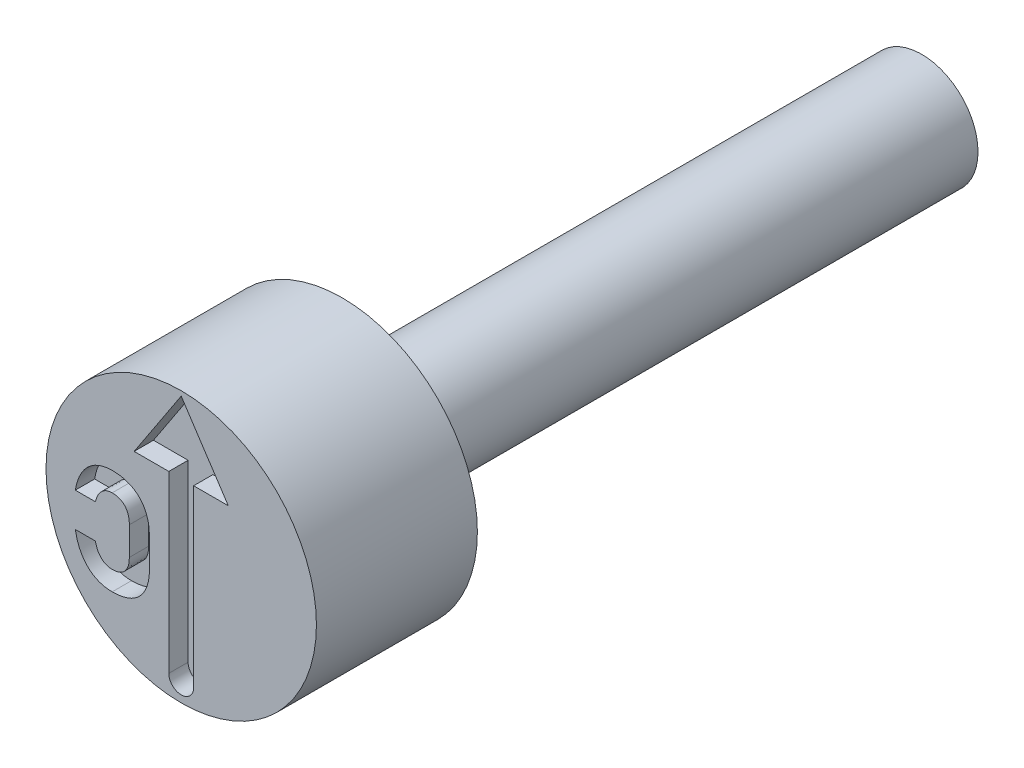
ISO-10303-21;
HEADER;
FILE_DESCRIPTION(('STEP AP214'),'2;1');
FILE_NAME('part.step','',(''),(''),'','','');
FILE_SCHEMA(('AUTOMOTIVE_DESIGN { 1 0 10303 214 1 1 1 1 }'));
ENDSEC;
DATA;
#1=APPLICATION_CONTEXT('core data for automotive mechanical design processes');
#2=APPLICATION_PROTOCOL_DEFINITION('international standard','automotive_design',2000,#1);
#3=PRODUCT_CONTEXT('',#1,'mechanical');
#4=PRODUCT('Part','Part','',(#3));
#5=PRODUCT_RELATED_PRODUCT_CATEGORY('part','',(#4));
#6=PRODUCT_DEFINITION_FORMATION('','',#4);
#7=PRODUCT_DEFINITION_CONTEXT('part definition',#1,'design');
#8=PRODUCT_DEFINITION('design','',#6,#7);
#9=PRODUCT_DEFINITION_SHAPE('','',#8);
#10=(LENGTH_UNIT() NAMED_UNIT(*) SI_UNIT(.MILLI.,.METRE.));
#11=(NAMED_UNIT(*) PLANE_ANGLE_UNIT() SI_UNIT($,.RADIAN.));
#12=(NAMED_UNIT(*) SI_UNIT($,.STERADIAN.) SOLID_ANGLE_UNIT());
#13=UNCERTAINTY_MEASURE_WITH_UNIT(LENGTH_MEASURE(1.E-05),#10,'distance_accuracy_value','');
#14=(GEOMETRIC_REPRESENTATION_CONTEXT(3) GLOBAL_UNCERTAINTY_ASSIGNED_CONTEXT((#13)) GLOBAL_UNIT_ASSIGNED_CONTEXT((#10,
#11,#12)) REPRESENTATION_CONTEXT('',''));
#15=CARTESIAN_POINT('',(0.,0.,0.));
#16=DIRECTION('',(0.,0.,1.));
#17=DIRECTION('',(1.,0.,0.));
#18=AXIS2_PLACEMENT_3D('',#15,#16,#17);
#19=CARTESIAN_POINT('',(0.,1.75,-5.));
#20=DIRECTION('',(0.,0.,1.));
#21=DIRECTION('',(1.,0.,0.));
#22=AXIS2_PLACEMENT_3D('',#19,#20,#21);
#23=PLANE('',#22);
#24=CARTESIAN_POINT('',(0.,0.,-5.));
#25=DIRECTION('',(0.,0.,1.));
#26=DIRECTION('',(1.,0.,0.));
#27=AXIS2_PLACEMENT_3D('',#24,#25,#26);
#28=CIRCLE('',#27,4.2);
#29=CARTESIAN_POINT('',(4.2,0.,-5.));
#30=VERTEX_POINT('',#29);
#31=EDGE_CURVE('E11',#30,#30,#28,.T.);
#32=ORIENTED_EDGE('',*,*,#31,.F.);
#33=EDGE_LOOP('',(#32));
#34=FACE_BOUND('',#33,.T.);
#35=CARTESIAN_POINT('',(0.,0.,-5.));
#36=DIRECTION('',(0.,0.,1.));
#37=DIRECTION('',(1.,0.,0.));
#38=AXIS2_PLACEMENT_3D('',#35,#36,#37);
#39=CIRCLE('',#38,1.75);
#40=CARTESIAN_POINT('',(1.75,0.,-5.));
#41=VERTEX_POINT('',#40);
#42=EDGE_CURVE('E262',#41,#41,#39,.T.);
#43=ORIENTED_EDGE('',*,*,#42,.T.);
#44=EDGE_LOOP('',(#43));
#45=FACE_BOUND('',#44,.T.);
#46=ADVANCED_FACE('F34',(#34,#45),#23,.F.);
#47=CARTESIAN_POINT('',(0.,0.,-0.403888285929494));
#48=DIRECTION('',(0.,0.,1.));
#49=DIRECTION('',(1.,0.,0.));
#50=AXIS2_PLACEMENT_3D('',#47,#48,#49);
#51=CYLINDRICAL_SURFACE('',#50,4.2);
#52=CARTESIAN_POINT('',(0.,0.,0.));
#53=DIRECTION('',(0.,0.,1.));
#54=DIRECTION('',(1.,0.,0.));
#55=AXIS2_PLACEMENT_3D('',#52,#53,#54);
#56=CIRCLE('',#55,4.2);
#57=CARTESIAN_POINT('',(4.2,0.,0.));
#58=VERTEX_POINT('',#57);
#59=EDGE_CURVE('E41',#58,#58,#56,.T.);
#60=ORIENTED_EDGE('',*,*,#59,.F.);
#61=EDGE_LOOP('',(#60));
#62=FACE_BOUND('',#61,.T.);
#63=ORIENTED_EDGE('',*,*,#31,.T.);
#64=EDGE_LOOP('',(#63));
#65=FACE_BOUND('',#64,.T.);
#66=ADVANCED_FACE('F247',(#62,#65),#51,.T.);
#67=CARTESIAN_POINT('',(0.,4.2,0.));
#68=DIRECTION('',(0.,0.,-1.));
#69=DIRECTION('',(-1.,0.,0.));
#70=AXIS2_PLACEMENT_3D('',#67,#68,#69);
#71=PLANE('',#70);
#72=CARTESIAN_POINT('',(-2.14381495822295,-2.28325861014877,0.));
#73=CARTESIAN_POINT('',(-2.11402266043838,-2.28293635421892,0.));
#74=CARTESIAN_POINT('',(-2.05523322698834,-2.28230044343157,0.));
#75=CARTESIAN_POINT('',(-1.96878811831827,-2.27568367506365,0.));
#76=CARTESIAN_POINT('',(-1.88538976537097,-2.26462278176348,0.));
#77=CARTESIAN_POINT('',(-1.80549296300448,-2.24902495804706,0.));
#78=CARTESIAN_POINT('',(-1.72887700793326,-2.22934785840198,0.));
#79=CARTESIAN_POINT('',(-1.65521388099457,-2.20609007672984,0.));
#80=CARTESIAN_POINT('',(-1.58521237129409,-2.17729798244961,0.));
#81=CARTESIAN_POINT('',(-1.51819306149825,-2.14464721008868,0.));
#82=CARTESIAN_POINT('',(-1.45509971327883,-2.10769157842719,0.));
#83=CARTESIAN_POINT('',(-1.39606602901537,-2.06612421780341,0.));
#84=CARTESIAN_POINT('',(-1.34050666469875,-2.02124932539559,0.));
#85=CARTESIAN_POINT('',(-1.28884326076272,-1.9721671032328,0.));
#86=CARTESIAN_POINT('',(-1.24112934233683,-1.91916434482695,0.));
#87=CARTESIAN_POINT('',(-1.19709358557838,-1.86218229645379,0.));
#88=CARTESIAN_POINT('',(-1.15764093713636,-1.80085743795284,0.));
#89=CARTESIAN_POINT('',(-1.12154947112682,-1.73601611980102,0.));
#90=CARTESIAN_POINT('',(-1.08943907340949,-1.66748111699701,0.));
#91=CARTESIAN_POINT('',(-1.06233754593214,-1.5949253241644,0.));
#92=CARTESIAN_POINT('',(-1.03884075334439,-1.51914991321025,0.));
#93=CARTESIAN_POINT('',(-1.01918537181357,-1.4401669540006,0.));
#94=CARTESIAN_POINT('',(-1.00413644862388,-1.35761744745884,0.));
#95=CARTESIAN_POINT('',(-0.99410541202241,-1.2715640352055,0.));
#96=CARTESIAN_POINT('',(-0.987151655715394,-1.18192573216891,0.));
#97=CARTESIAN_POINT('',(-0.986577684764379,-1.12096024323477,0.));
#98=CARTESIAN_POINT('',(-0.9862848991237,-1.08986142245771,0.));
#99=B_SPLINE_CURVE_WITH_KNOTS('',3,(#72,#73,#74,#75,#76,#77,#78,#79,#80,#81,#82,#83,#84,#85,#86,
#87,#88,#89,#90,#91,#92,#93,#94,#95,#96,#97,#98),.UNSPECIFIED.,.F.,.F.,(4,1,1,1,1,1,1,1,1,1,1,1,
1,1,1,1,1,1,1,1,1,1,1,1,4),(0.,0.0472598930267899,0.093258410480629,0.137448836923,
0.180669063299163,0.222325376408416,0.262898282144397,0.303117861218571,0.342294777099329,
0.381096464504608,0.418984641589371,0.456742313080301,0.494310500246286,0.531916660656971,
0.569787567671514,0.608434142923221,0.647492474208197,0.687453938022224,0.728384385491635,
0.770272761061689,0.813266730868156,0.85743965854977,0.903297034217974,0.950671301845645,1.),.UNSPECIFIED.);
#100=CARTESIAN_POINT('',(-2.14381495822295,-2.28325861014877,0.));
#101=VERTEX_POINT('',#100);
#102=CARTESIAN_POINT('',(-0.9862848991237,-1.08986142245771,0.));
#103=VERTEX_POINT('',#102);
#104=EDGE_CURVE('E400',#101,#103,#99,.T.);
#105=ORIENTED_EDGE('',*,*,#104,.F.);
#106=CARTESIAN_POINT('',(-3.29025881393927,-1.17789891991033,0.));
#107=CARTESIAN_POINT('',(-3.27911379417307,-1.23444502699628,0.));
#108=CARTESIAN_POINT('',(-3.25744584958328,-1.34438093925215,0.));
#109=CARTESIAN_POINT('',(-3.2087542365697,-1.50093744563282,0.));
#110=CARTESIAN_POINT('',(-3.14875022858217,-1.64477801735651,0.));
#111=CARTESIAN_POINT('',(-3.07734210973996,-1.77568690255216,0.));
#112=CARTESIAN_POINT('',(-2.99409454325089,-1.89236962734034,0.));
#113=CARTESIAN_POINT('',(-2.90099938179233,-1.99526256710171,0.));
#114=CARTESIAN_POINT('',(-2.79726991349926,-2.08349743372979,0.));
#115=CARTESIAN_POINT('',(-2.6831195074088,-2.1561875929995,0.));
#116=CARTESIAN_POINT('',(-2.55986380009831,-2.21333326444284,0.));
#117=CARTESIAN_POINT('',(-2.42817733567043,-2.25346530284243,0.));
#118=CARTESIAN_POINT('',(-2.28873872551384,-2.27942869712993,0.));
#119=CARTESIAN_POINT('',(-2.19284392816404,-2.28196291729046,0.));
#120=CARTESIAN_POINT('',(-2.14381495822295,-2.28325861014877,0.));
#121=B_SPLINE_CURVE_WITH_KNOTS('',3,(#106,#107,#108,#109,#110,#111,#112,#113,#114,#115,#116,
#117,#118,#119,#120),.UNSPECIFIED.,.F.,.F.,(4,1,1,1,1,1,1,1,1,1,1,1,4),(0.,0.098823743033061,
0.192131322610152,0.28071953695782,0.365844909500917,0.447392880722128,0.526064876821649,
0.603327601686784,0.680299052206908,0.757555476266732,0.835645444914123,0.915969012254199,1.),.UNSPECIFIED.);
#122=CARTESIAN_POINT('',(-3.29025881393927,-1.17789891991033,0.));
#123=VERTEX_POINT('',#122);
#124=EDGE_CURVE('E48',#123,#101,#121,.T.);
#125=ORIENTED_EDGE('',*,*,#124,.F.);
#126=DIRECTION('',(-1.,0.,0.));
#127=VECTOR('',#126,1.);
#128=CARTESIAN_POINT('',(-2.66551864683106,-1.17789891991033,0.));
#129=LINE('',#128,#127);
#130=CARTESIAN_POINT('',(-2.66551864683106,-1.17789891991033,0.));
#131=VERTEX_POINT('',#130);
#132=EDGE_CURVE('E185',#131,#123,#129,.T.);
#133=ORIENTED_EDGE('',*,*,#132,.F.);
#134=CARTESIAN_POINT('',(-2.14381495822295,-1.68003872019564,0.));
#135=CARTESIAN_POINT('',(-2.16536954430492,-1.67918933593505,0.));
#136=CARTESIAN_POINT('',(-2.20764643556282,-1.67752336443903,0.));
#137=CARTESIAN_POINT('',(-2.26940868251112,-1.6673246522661,0.));
#138=CARTESIAN_POINT('',(-2.32755981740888,-1.64852895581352,0.));
#139=CARTESIAN_POINT('',(-2.38249228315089,-1.62320425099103,0.));
#140=CARTESIAN_POINT('',(-2.43380341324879,-1.5904852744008,0.));
#141=CARTESIAN_POINT('',(-2.48003047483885,-1.55005895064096,0.));
#142=CARTESIAN_POINT('',(-2.52308827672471,-1.50404183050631,0.));
#143=CARTESIAN_POINT('',(-2.56141109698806,-1.45093584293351,0.));
#144=CARTESIAN_POINT('',(-2.59538279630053,-1.39150733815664,0.));
#145=CARTESIAN_POINT('',(-2.62379258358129,-1.32573346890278,0.));
#146=CARTESIAN_POINT('',(-2.648453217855,-1.2543467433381,0.));
#147=CARTESIAN_POINT('',(-2.65971367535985,-1.20390338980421,0.));
#148=CARTESIAN_POINT('',(-2.66551864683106,-1.17789891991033,0.));
#149=B_SPLINE_CURVE_WITH_KNOTS('',3,(#134,#135,#136,#137,#138,#139,#140,#141,#142,#143,#144,
#145,#146,#147,#148),.UNSPECIFIED.,.F.,.F.,(4,1,1,1,1,1,1,1,1,1,1,1,4),(0.,0.081756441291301,
0.160356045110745,0.236478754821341,0.312819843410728,0.389192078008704,0.466352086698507,
0.545094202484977,0.627698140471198,0.714093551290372,0.80415108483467,0.89903630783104,1.),.UNSPECIFIED.);
#150=CARTESIAN_POINT('',(-2.14381495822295,-1.68003872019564,0.));
#151=VERTEX_POINT('',#150);
#152=EDGE_CURVE('E188',#151,#131,#149,.T.);
#153=ORIENTED_EDGE('',*,*,#152,.F.);
#154=CARTESIAN_POINT('',(-1.61102506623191,-1.08986142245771,0.));
#155=CARTESIAN_POINT('',(-1.61172801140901,-1.11989880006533,0.));
#156=CARTESIAN_POINT('',(-1.61308875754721,-1.1780445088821,0.));
#157=CARTESIAN_POINT('',(-1.62487750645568,-1.26181245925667,0.));
#158=CARTESIAN_POINT('',(-1.64438127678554,-1.33886599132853,0.));
#159=CARTESIAN_POINT('',(-1.6714405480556,-1.40907376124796,0.));
#160=CARTESIAN_POINT('',(-1.70698483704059,-1.47143383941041,0.));
#161=CARTESIAN_POINT('',(-1.7491962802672,-1.52644994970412,0.));
#162=CARTESIAN_POINT('',(-1.7983187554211,-1.5739892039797,0.));
#163=CARTESIAN_POINT('',(-1.85511474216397,-1.61266859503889,0.));
#164=CARTESIAN_POINT('',(-1.91847350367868,-1.64292402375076,0.));
#165=CARTESIAN_POINT('',(-1.98815257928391,-1.66419137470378,0.));
#166=CARTESIAN_POINT('',(-2.06396630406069,-1.67754135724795,0.));
#167=CARTESIAN_POINT('',(-2.11658468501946,-1.67918706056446,0.));
#168=CARTESIAN_POINT('',(-2.14381495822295,-1.68003872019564,0.));
#169=B_SPLINE_CURVE_WITH_KNOTS('',3,(#154,#155,#156,#157,#158,#159,#160,#161,#162,#163,#164,
#165,#166,#167,#168),.UNSPECIFIED.,.F.,.F.,(4,1,1,1,1,1,1,1,1,1,1,1,4),(0.,0.0997433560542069,
0.193081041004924,0.280299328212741,0.363302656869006,0.442209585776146,0.517891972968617,
0.592965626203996,0.66827505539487,0.745143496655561,0.825309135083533,0.909596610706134,1.),.UNSPECIFIED.);
#170=CARTESIAN_POINT('',(-1.61102506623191,-1.08986142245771,0.));
#171=VERTEX_POINT('',#170);
#172=EDGE_CURVE('E348',#171,#151,#169,.T.);
#173=ORIENTED_EDGE('',*,*,#172,.F.);
#174=DIRECTION('',(0.,-1.,0.));
#175=VECTOR('',#174,1.);
#176=CARTESIAN_POINT('',(-1.61102506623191,-0.212094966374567,0.));
#177=LINE('',#176,#175);
#178=CARTESIAN_POINT('',(-1.61102506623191,-0.212094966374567,0.));
#179=VERTEX_POINT('',#178);
#180=EDGE_CURVE('E356',#179,#171,#177,.T.);
#181=ORIENTED_EDGE('',*,*,#180,.F.);
#182=CARTESIAN_POINT('',(-2.14381495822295,0.380038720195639,0.));
#183=CARTESIAN_POINT('',(-2.11660499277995,0.37908614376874,0.));
#184=CARTESIAN_POINT('',(-2.06406218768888,0.377246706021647,0.));
#185=CARTESIAN_POINT('',(-1.98794448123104,0.365263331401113,0.));
#186=CARTESIAN_POINT('',(-1.91860966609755,0.342688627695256,0.));
#187=CARTESIAN_POINT('',(-1.85508938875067,0.31274098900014,0.));
#188=CARTESIAN_POINT('',(-1.79834595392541,0.27395315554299,0.));
#189=CARTESIAN_POINT('',(-1.74898758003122,0.226402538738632,0.));
#190=CARTESIAN_POINT('',(-1.70698935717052,0.170734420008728,0.));
#191=CARTESIAN_POINT('',(-1.67159986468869,0.107906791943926,0.));
#192=CARTESIAN_POINT('',(-1.64423601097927,0.0373868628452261,0.));
#193=CARTESIAN_POINT('',(-1.62498243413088,-0.0399553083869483,0.));
#194=CARTESIAN_POINT('',(-1.61306786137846,-0.12390621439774,0.));
#195=CARTESIAN_POINT('',(-1.61172089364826,-0.182055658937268,0.));
#196=CARTESIAN_POINT('',(-1.61102506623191,-0.212094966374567,0.));
#197=B_SPLINE_CURVE_WITH_KNOTS('',3,(#182,#183,#184,#185,#186,#187,#188,#189,#190,#191,#192,
#193,#194,#195,#196),.UNSPECIFIED.,.F.,.F.,(4,1,1,1,1,1,1,1,1,1,1,1,4),(0.,0.0902231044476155,
0.174222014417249,0.25444494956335,0.331160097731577,0.406319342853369,0.481243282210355,
0.557346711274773,0.636723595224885,0.719561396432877,0.807304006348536,0.900455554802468,1.),.UNSPECIFIED.);
#198=CARTESIAN_POINT('',(-2.14381495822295,0.380038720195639,0.));
#199=VERTEX_POINT('',#198);
#200=EDGE_CURVE('E362',#199,#179,#197,.T.);
#201=ORIENTED_EDGE('',*,*,#200,.F.);
#202=CARTESIAN_POINT('',(-2.66551864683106,-0.121448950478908,0.));
#203=CARTESIAN_POINT('',(-2.65921699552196,-0.0958874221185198,0.));
#204=CARTESIAN_POINT('',(-2.64695455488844,-0.0461470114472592,0.));
#205=CARTESIAN_POINT('',(-2.62170707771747,0.024612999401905,0.));
#206=CARTESIAN_POINT('',(-2.59299817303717,0.0901557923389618,0.));
#207=CARTESIAN_POINT('',(-2.55788725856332,0.148919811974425,0.));
#208=CARTESIAN_POINT('',(-2.519665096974,0.202323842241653,0.));
#209=CARTESIAN_POINT('',(-2.4765593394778,0.248591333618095,0.));
#210=CARTESIAN_POINT('',(-2.42951346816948,0.288489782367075,0.));
#211=CARTESIAN_POINT('',(-2.37889075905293,0.321488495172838,0.));
#212=CARTESIAN_POINT('',(-2.3248290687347,0.348381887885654,0.));
#213=CARTESIAN_POINT('',(-2.26708234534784,0.366180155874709,0.));
#214=CARTESIAN_POINT('',(-2.20644779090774,0.377802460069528,0.));
#215=CARTESIAN_POINT('',(-2.16495562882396,0.37928390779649,0.));
#216=CARTESIAN_POINT('',(-2.14381495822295,0.380038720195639,0.));
#217=B_SPLINE_CURVE_WITH_KNOTS('',3,(#202,#203,#204,#205,#206,#207,#208,#209,#210,#211,#212,
#213,#214,#215,#216),.UNSPECIFIED.,.F.,.F.,(4,1,1,1,1,1,1,1,1,1,1,1,4),(0.,0.100258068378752,
0.195093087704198,0.285925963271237,0.372441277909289,0.455447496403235,0.535743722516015,
0.612742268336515,0.689936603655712,0.765509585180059,0.842003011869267,0.919498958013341,1.),.UNSPECIFIED.);
#218=CARTESIAN_POINT('',(-2.66551864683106,-0.121448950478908,0.));
#219=VERTEX_POINT('',#218);
#220=EDGE_CURVE('E367',#219,#199,#217,.T.);
#221=ORIENTED_EDGE('',*,*,#220,.F.);
#222=DIRECTION('',(1.,0.,0.));
#223=VECTOR('',#222,1.);
#224=CARTESIAN_POINT('',(-3.29025881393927,-0.121448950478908,0.));
#225=LINE('',#224,#223);
#226=CARTESIAN_POINT('',(-3.29025881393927,-0.121448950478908,0.));
#227=VERTEX_POINT('',#226);
#228=EDGE_CURVE('E375',#227,#219,#225,.T.);
#229=ORIENTED_EDGE('',*,*,#228,.F.);
#230=CARTESIAN_POINT('',(-2.14381495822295,0.983258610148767,0.));
#231=CARTESIAN_POINT('',(-2.1928414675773,0.981946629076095,0.));
#232=CARTESIAN_POINT('',(-2.28894564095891,0.979374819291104,0.));
#233=CARTESIAN_POINT('',(-2.42862557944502,0.953552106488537,0.));
#234=CARTESIAN_POINT('',(-2.56052908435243,0.913349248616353,0.));
#235=CARTESIAN_POINT('',(-2.6838852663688,0.856023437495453,0.));
#236=CARTESIAN_POINT('',(-2.79830794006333,0.783695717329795,0.));
#237=CARTESIAN_POINT('',(-2.90245748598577,0.695695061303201,0.));
#238=CARTESIAN_POINT('',(-2.99629887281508,0.59317388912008,0.));
#239=CARTESIAN_POINT('',(-3.07902206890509,0.475713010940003,0.));
#240=CARTESIAN_POINT('',(-3.15086271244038,0.344951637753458,0.));
#241=CARTESIAN_POINT('',(-3.21000466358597,0.200873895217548,0.));
#242=CARTESIAN_POINT('',(-3.25801038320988,0.0445539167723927,0.));
#243=CARTESIAN_POINT('',(-3.27931719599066,-0.0651255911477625,0.));
#244=CARTESIAN_POINT('',(-3.29025881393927,-0.121448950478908,0.));
#245=B_SPLINE_CURVE_WITH_KNOTS('',3,(#230,#231,#232,#233,#234,#235,#236,#237,#238,#239,#240,
#241,#242,#243,#244),.UNSPECIFIED.,.F.,.F.,(4,1,1,1,1,1,1,1,1,1,1,1,4),(0.,0.0840057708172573,
0.164672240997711,0.242738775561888,0.319972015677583,0.397234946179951,0.474233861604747,
0.553133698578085,0.634960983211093,0.720060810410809,0.808478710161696,0.901648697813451,1.),.UNSPECIFIED.);
#246=CARTESIAN_POINT('',(-2.14381495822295,0.983258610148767,0.));
#247=VERTEX_POINT('',#246);
#248=EDGE_CURVE('E381',#247,#227,#245,.T.);
#249=ORIENTED_EDGE('',*,*,#248,.F.);
#250=CARTESIAN_POINT('',(-0.9862848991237,-0.212094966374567,0.));
#251=CARTESIAN_POINT('',(-0.986577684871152,-0.180996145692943,0.));
#252=CARTESIAN_POINT('',(-0.987151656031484,-0.120030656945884,0.));
#253=CARTESIAN_POINT('',(-0.994105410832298,-0.0303923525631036,0.));
#254=CARTESIAN_POINT('',(-1.00413645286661,0.0556610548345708,0.));
#255=CARTESIAN_POINT('',(-1.0191853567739,0.13821057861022,0.));
#256=CARTESIAN_POINT('',(-1.03884080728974,0.217193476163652,0.));
#257=CARTESIAN_POINT('',(-1.06233735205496,0.292969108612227,0.));
#258=CARTESIAN_POINT('',(-1.08943977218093,0.365524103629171,0.));
#259=CARTESIAN_POINT('',(-1.1215469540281,0.434061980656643,0.));
#260=CARTESIAN_POINT('',(-1.15765006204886,0.498892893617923,0.));
#261=CARTESIAN_POINT('',(-1.19706018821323,0.560255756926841,0.));
#262=CARTESIAN_POINT('',(-1.2413503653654,0.617227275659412,0.));
#263=CARTESIAN_POINT('',(-1.28861113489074,0.670853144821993,0.));
#264=CARTESIAN_POINT('',(-1.34053575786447,0.71992116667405,0.));
#265=CARTESIAN_POINT('',(-1.39606451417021,0.764813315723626,0.));
#266=CARTESIAN_POINT('',(-1.45507624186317,0.806438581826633,0.));
#267=CARTESIAN_POINT('',(-1.51837505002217,0.843186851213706,0.));
#268=CARTESIAN_POINT('',(-1.58500837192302,0.876859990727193,0.));
#269=CARTESIAN_POINT('',(-1.65537256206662,0.905195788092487,0.));
#270=CARTESIAN_POINT('',(-1.72873256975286,0.929566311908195,0.));
#271=CARTESIAN_POINT('',(-1.80551526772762,0.948958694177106,0.));
#272=CARTESIAN_POINT('',(-1.8853835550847,0.964641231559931,0.));
#273=CARTESIAN_POINT('',(-1.96878986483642,0.975678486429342,0.));
#274=CARTESIAN_POINT('',(-2.05523276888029,0.982301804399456,0.));
#275=CARTESIAN_POINT('',(-2.11402250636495,0.982936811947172,0.));
#276=CARTESIAN_POINT('',(-2.14381495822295,0.983258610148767,0.));
#277=B_SPLINE_CURVE_WITH_KNOTS('',3,(#250,#251,#252,#253,#254,#255,#256,#257,#258,#259,#260,
#261,#262,#263,#264,#265,#266,#267,#268,#269,#270,#271,#272,#273,#274,#275,#276),.UNSPECIFIED.,
.F.,.F.,(4,1,1,1,1,1,1,1,1,1,1,1,1,1,1,1,1,1,1,1,1,1,1,1,4),(0.,0.0493032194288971,
0.0966530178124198,0.142486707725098,0.186636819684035,0.229608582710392,0.271475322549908,
0.312384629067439,0.352325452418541,0.391363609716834,0.429990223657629,0.467841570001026,
0.505685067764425,0.543233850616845,0.580972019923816,0.618840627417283,0.657622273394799,
0.69693189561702,0.737130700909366,0.777789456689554,0.819424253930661,0.862622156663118,
0.906789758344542,0.952764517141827,1.),.UNSPECIFIED.);
#278=CARTESIAN_POINT('',(-0.9862848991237,-0.212094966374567,0.));
#279=VERTEX_POINT('',#278);
#280=EDGE_CURVE('E386',#279,#247,#277,.T.);
#281=ORIENTED_EDGE('',*,*,#280,.F.);
#282=DIRECTION('',(0.,1.,0.));
#283=VECTOR('',#282,1.);
#284=CARTESIAN_POINT('',(-0.9862848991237,-1.08986142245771,0.));
#285=LINE('',#284,#283);
#286=EDGE_CURVE('E394',#103,#279,#285,.T.);
#287=ORIENTED_EDGE('',*,*,#286,.F.);
#288=EDGE_LOOP('',(#105,#125,#133,#153,#173,#181,#201,#221,#229,#249,#281,#287));
#289=FACE_BOUND('',#288,.T.);
#290=DIRECTION('',(0.,1.,0.));
#291=VECTOR('',#290,1.);
#292=CARTESIAN_POINT('',(0.385708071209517,1.83536164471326,0.));
#293=LINE('',#292,#291);
#294=CARTESIAN_POINT('',(0.385708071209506,-3.59672771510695,0.));
#295=VERTEX_POINT('',#294);
#296=CARTESIAN_POINT('',(0.385708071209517,1.83536164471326,0.));
#297=VERTEX_POINT('',#296);
#298=EDGE_CURVE('E300',#295,#297,#293,.T.);
#299=ORIENTED_EDGE('',*,*,#298,.F.);
#300=CARTESIAN_POINT('',(3.30934598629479E-13,-3.59672771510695,0.));
#301=DIRECTION('',(0.,0.,1.));
#302=DIRECTION('',(1.,0.,0.));
#303=AXIS2_PLACEMENT_3D('',#300,#301,#302);
#304=CIRCLE('',#303,0.385708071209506);
#305=CARTESIAN_POINT('',(-0.385708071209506,-3.59672771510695,0.));
#306=VERTEX_POINT('',#305);
#307=EDGE_CURVE('E56',#306,#295,#304,.T.);
#308=ORIENTED_EDGE('',*,*,#307,.F.);
#309=DIRECTION('',(0.,-1.,0.));
#310=VECTOR('',#309,1.);
#311=CARTESIAN_POINT('',(-0.385708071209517,1.83536164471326,0.));
#312=LINE('',#311,#310);
#313=CARTESIAN_POINT('',(-0.385708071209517,1.83536164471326,0.));
#314=VERTEX_POINT('',#313);
#315=EDGE_CURVE('E284',#314,#306,#312,.T.);
#316=ORIENTED_EDGE('',*,*,#315,.F.);
#317=DIRECTION('',(1.,0.,0.));
#318=VECTOR('',#317,1.);
#319=CARTESIAN_POINT('',(-1.46188328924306,1.83536164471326,0.));
#320=LINE('',#319,#318);
#321=CARTESIAN_POINT('',(-1.46188328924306,1.83536164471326,0.));
#322=VERTEX_POINT('',#321);
#323=EDGE_CURVE('E288',#322,#314,#320,.T.);
#324=ORIENTED_EDGE('',*,*,#323,.F.);
#325=DIRECTION('',(-0.550159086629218,-0.835059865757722,0.));
#326=VECTOR('',#325,1.);
#327=CARTESIAN_POINT('',(0.,4.05428357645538,0.));
#328=LINE('',#327,#326);
#329=CARTESIAN_POINT('',(0.,4.05428357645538,0.));
#330=VERTEX_POINT('',#329);
#331=EDGE_CURVE('E291',#330,#322,#328,.T.);
#332=ORIENTED_EDGE('',*,*,#331,.F.);
#333=DIRECTION('',(-0.550159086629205,0.835059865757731,0.));
#334=VECTOR('',#333,1.);
#335=CARTESIAN_POINT('',(0.,4.05428357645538,0.));
#336=LINE('',#335,#334);
#337=CARTESIAN_POINT('',(1.46188328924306,1.83536164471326,0.));
#338=VERTEX_POINT('',#337);
#339=EDGE_CURVE('E294',#338,#330,#336,.T.);
#340=ORIENTED_EDGE('',*,*,#339,.F.);
#341=DIRECTION('',(1.,0.,0.));
#342=VECTOR('',#341,1.);
#343=CARTESIAN_POINT('',(1.46188328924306,1.83536164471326,0.));
#344=LINE('',#343,#342);
#345=EDGE_CURVE('E297',#297,#338,#344,.T.);
#346=ORIENTED_EDGE('',*,*,#345,.F.);
#347=EDGE_LOOP('',(#299,#308,#316,#324,#332,#340,#346));
#348=FACE_BOUND('',#347,.T.);
#349=ORIENTED_EDGE('',*,*,#59,.T.);
#350=EDGE_LOOP('',(#349));
#351=FACE_BOUND('',#350,.T.);
#352=ADVANCED_FACE('F244',(#289,#348,#351),#71,.F.);
#353=CARTESIAN_POINT('',(0.,0.,-23.));
#354=DIRECTION('',(0.,0.,1.));
#355=DIRECTION('',(1.,0.,0.));
#356=AXIS2_PLACEMENT_3D('',#353,#354,#355);
#357=PLANE('',#356);
#358=CARTESIAN_POINT('',(0.,0.,-23.));
#359=DIRECTION('',(0.,0.,1.));
#360=DIRECTION('',(1.,0.,0.));
#361=AXIS2_PLACEMENT_3D('',#358,#359,#360);
#362=CIRCLE('',#361,1.75);
#363=CARTESIAN_POINT('',(1.75,0.,-23.));
#364=VERTEX_POINT('',#363);
#365=EDGE_CURVE('E263',#364,#364,#362,.T.);
#366=ORIENTED_EDGE('',*,*,#365,.F.);
#367=EDGE_LOOP('',(#366));
#368=FACE_BOUND('',#367,.T.);
#369=ADVANCED_FACE('F240',(#368),#357,.F.);
#370=CARTESIAN_POINT('',(0.,0.,-0.403888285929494));
#371=DIRECTION('',(0.,0.,1.));
#372=DIRECTION('',(1.,0.,0.));
#373=AXIS2_PLACEMENT_3D('',#370,#371,#372);
#374=CYLINDRICAL_SURFACE('',#373,1.75);
#375=ORIENTED_EDGE('',*,*,#42,.F.);
#376=EDGE_LOOP('',(#375));
#377=FACE_BOUND('',#376,.T.);
#378=ORIENTED_EDGE('',*,*,#365,.T.);
#379=EDGE_LOOP('',(#378));
#380=FACE_BOUND('',#379,.T.);
#381=ADVANCED_FACE('F237',(#377,#380),#374,.T.);
#382=CARTESIAN_POINT('',(3.30934598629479E-13,-3.59672771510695,-0.6));
#383=DIRECTION('',(0.,0.,1.));
#384=DIRECTION('',(1.,0.,0.));
#385=AXIS2_PLACEMENT_3D('',#382,#383,#384);
#386=CYLINDRICAL_SURFACE('',#385,0.385708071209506);
#387=ORIENTED_EDGE('',*,*,#307,.T.);
#388=DIRECTION('',(0.,0.,1.));
#389=VECTOR('',#388,1.);
#390=CARTESIAN_POINT('',(0.385708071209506,-3.59672771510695,-0.6));
#391=LINE('',#390,#389);
#392=CARTESIAN_POINT('',(0.385708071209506,-3.59672771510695,-0.6));
#393=VERTEX_POINT('',#392);
#394=EDGE_CURVE('E271',#393,#295,#391,.T.);
#395=ORIENTED_EDGE('',*,*,#394,.F.);
#396=CARTESIAN_POINT('',(3.30934598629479E-13,-3.59672771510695,-0.6));
#397=DIRECTION('',(0.,0.,1.));
#398=DIRECTION('',(1.,0.,0.));
#399=AXIS2_PLACEMENT_3D('',#396,#397,#398);
#400=CIRCLE('',#399,0.385708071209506);
#401=CARTESIAN_POINT('',(-0.385708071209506,-3.59672771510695,-0.6));
#402=VERTEX_POINT('',#401);
#403=EDGE_CURVE('E287',#402,#393,#400,.T.);
#404=ORIENTED_EDGE('',*,*,#403,.F.);
#405=DIRECTION('',(0.,0.,1.));
#406=VECTOR('',#405,1.);
#407=CARTESIAN_POINT('',(-0.385708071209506,-3.59672771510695,-0.6));
#408=LINE('',#407,#406);
#409=EDGE_CURVE('E264',#402,#306,#408,.T.);
#410=ORIENTED_EDGE('',*,*,#409,.T.);
#411=EDGE_LOOP('',(#387,#395,#404,#410));
#412=FACE_BOUND('',#411,.T.);
#413=ADVANCED_FACE('F215',(#412),#386,.F.);
#414=CARTESIAN_POINT('',(-0.385708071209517,1.83536164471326,-0.6));
#415=DIRECTION('',(-1.,0.,0.));
#416=DIRECTION('',(0.,-1.,0.));
#417=AXIS2_PLACEMENT_3D('',#414,#415,#416);
#418=PLANE('',#417);
#419=ORIENTED_EDGE('',*,*,#315,.T.);
#420=ORIENTED_EDGE('',*,*,#409,.F.);
#421=DIRECTION('',(0.,-1.,0.));
#422=VECTOR('',#421,1.);
#423=CARTESIAN_POINT('',(-0.385708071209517,1.83536164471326,-0.6));
#424=LINE('',#423,#422);
#425=CARTESIAN_POINT('',(-0.385708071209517,1.83536164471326,-0.6));
#426=VERTEX_POINT('',#425);
#427=EDGE_CURVE('E275',#426,#402,#424,.T.);
#428=ORIENTED_EDGE('',*,*,#427,.F.);
#429=DIRECTION('',(0.,0.,1.));
#430=VECTOR('',#429,1.);
#431=CARTESIAN_POINT('',(-0.385708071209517,1.83536164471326,-0.6));
#432=LINE('',#431,#430);
#433=EDGE_CURVE('E268',#426,#314,#432,.T.);
#434=ORIENTED_EDGE('',*,*,#433,.T.);
#435=EDGE_LOOP('',(#419,#420,#428,#434));
#436=FACE_BOUND('',#435,.T.);
#437=ADVANCED_FACE('F211',(#436),#418,.F.);
#438=CARTESIAN_POINT('',(-1.46188328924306,1.83536164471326,-0.6));
#439=DIRECTION('',(0.,-1.,0.));
#440=DIRECTION('',(0.,0.,-1.));
#441=AXIS2_PLACEMENT_3D('',#438,#439,#440);
#442=PLANE('',#441);
#443=ORIENTED_EDGE('',*,*,#323,.T.);
#444=ORIENTED_EDGE('',*,*,#433,.F.);
#445=DIRECTION('',(1.,0.,0.));
#446=VECTOR('',#445,1.);
#447=CARTESIAN_POINT('',(-1.46188328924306,1.83536164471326,-0.6));
#448=LINE('',#447,#446);
#449=CARTESIAN_POINT('',(-1.46188328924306,1.83536164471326,-0.6));
#450=VERTEX_POINT('',#449);
#451=EDGE_CURVE('E307',#450,#426,#448,.T.);
#452=ORIENTED_EDGE('',*,*,#451,.F.);
#453=DIRECTION('',(0.,0.,1.));
#454=VECTOR('',#453,1.);
#455=CARTESIAN_POINT('',(-1.46188328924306,1.83536164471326,-0.6));
#456=LINE('',#455,#454);
#457=EDGE_CURVE('E281',#450,#322,#456,.T.);
#458=ORIENTED_EDGE('',*,*,#457,.T.);
#459=EDGE_LOOP('',(#443,#444,#452,#458));
#460=FACE_BOUND('',#459,.T.);
#461=ADVANCED_FACE('F214',(#460),#442,.F.);
#462=CARTESIAN_POINT('',(0.,4.05428357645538,-0.6));
#463=DIRECTION('',(-0.835059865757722,0.550159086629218,0.));
#464=DIRECTION('',(-0.550159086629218,-0.835059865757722,0.));
#465=AXIS2_PLACEMENT_3D('',#462,#463,#464);
#466=PLANE('',#465);
#467=ORIENTED_EDGE('',*,*,#331,.T.);
#468=ORIENTED_EDGE('',*,*,#457,.F.);
#469=DIRECTION('',(-0.550159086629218,-0.835059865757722,0.));
#470=VECTOR('',#469,1.);
#471=CARTESIAN_POINT('',(0.,4.05428357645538,-0.6));
#472=LINE('',#471,#470);
#473=CARTESIAN_POINT('',(0.,4.05428357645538,-0.6));
#474=VERTEX_POINT('',#473);
#475=EDGE_CURVE('E310',#474,#450,#472,.T.);
#476=ORIENTED_EDGE('',*,*,#475,.F.);
#477=DIRECTION('',(0.,0.,1.));
#478=VECTOR('',#477,1.);
#479=CARTESIAN_POINT('',(0.,4.05428357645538,-0.6));
#480=LINE('',#479,#478);
#481=EDGE_CURVE('E279',#474,#330,#480,.T.);
#482=ORIENTED_EDGE('',*,*,#481,.T.);
#483=EDGE_LOOP('',(#467,#468,#476,#482));
#484=FACE_BOUND('',#483,.T.);
#485=ADVANCED_FACE('F219',(#484),#466,.F.);
#486=CARTESIAN_POINT('',(0.,4.05428357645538,-0.6));
#487=DIRECTION('',(0.835059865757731,0.550159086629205,0.));
#488=DIRECTION('',(-0.550159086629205,0.835059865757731,0.));
#489=AXIS2_PLACEMENT_3D('',#486,#487,#488);
#490=PLANE('',#489);
#491=ORIENTED_EDGE('',*,*,#339,.T.);
#492=ORIENTED_EDGE('',*,*,#481,.F.);
#493=DIRECTION('',(-0.550159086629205,0.835059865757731,0.));
#494=VECTOR('',#493,1.);
#495=CARTESIAN_POINT('',(0.,4.05428357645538,-0.6));
#496=LINE('',#495,#494);
#497=CARTESIAN_POINT('',(1.46188328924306,1.83536164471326,-0.6));
#498=VERTEX_POINT('',#497);
#499=EDGE_CURVE('E313',#498,#474,#496,.T.);
#500=ORIENTED_EDGE('',*,*,#499,.F.);
#501=DIRECTION('',(0.,0.,1.));
#502=VECTOR('',#501,1.);
#503=CARTESIAN_POINT('',(1.46188328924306,1.83536164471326,-0.6));
#504=LINE('',#503,#502);
#505=EDGE_CURVE('E277',#498,#338,#504,.T.);
#506=ORIENTED_EDGE('',*,*,#505,.T.);
#507=EDGE_LOOP('',(#491,#492,#500,#506));
#508=FACE_BOUND('',#507,.T.);
#509=ADVANCED_FACE('F223',(#508),#490,.F.);
#510=CARTESIAN_POINT('',(1.46188328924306,1.83536164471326,-0.6));
#511=DIRECTION('',(0.,-1.,0.));
#512=DIRECTION('',(0.,0.,-1.));
#513=AXIS2_PLACEMENT_3D('',#510,#511,#512);
#514=PLANE('',#513);
#515=ORIENTED_EDGE('',*,*,#345,.T.);
#516=ORIENTED_EDGE('',*,*,#505,.F.);
#517=DIRECTION('',(1.,0.,0.));
#518=VECTOR('',#517,1.);
#519=CARTESIAN_POINT('',(1.46188328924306,1.83536164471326,-0.6));
#520=LINE('',#519,#518);
#521=CARTESIAN_POINT('',(0.385708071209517,1.83536164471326,-0.6));
#522=VERTEX_POINT('',#521);
#523=EDGE_CURVE('E316',#522,#498,#520,.T.);
#524=ORIENTED_EDGE('',*,*,#523,.F.);
#525=DIRECTION('',(0.,0.,1.));
#526=VECTOR('',#525,1.);
#527=CARTESIAN_POINT('',(0.385708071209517,1.83536164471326,-0.6));
#528=LINE('',#527,#526);
#529=EDGE_CURVE('E274',#522,#297,#528,.T.);
#530=ORIENTED_EDGE('',*,*,#529,.T.);
#531=EDGE_LOOP('',(#515,#516,#524,#530));
#532=FACE_BOUND('',#531,.T.);
#533=ADVANCED_FACE('F227',(#532),#514,.F.);
#534=CARTESIAN_POINT('',(0.385708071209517,1.83536164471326,-0.6));
#535=DIRECTION('',(1.,0.,0.));
#536=DIRECTION('',(0.,1.,0.));
#537=AXIS2_PLACEMENT_3D('',#534,#535,#536);
#538=PLANE('',#537);
#539=ORIENTED_EDGE('',*,*,#298,.T.);
#540=ORIENTED_EDGE('',*,*,#529,.F.);
#541=DIRECTION('',(0.,1.,0.));
#542=VECTOR('',#541,1.);
#543=CARTESIAN_POINT('',(0.385708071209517,1.83536164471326,-0.6));
#544=LINE('',#543,#542);
#545=EDGE_CURVE('E319',#393,#522,#544,.T.);
#546=ORIENTED_EDGE('',*,*,#545,.F.);
#547=ORIENTED_EDGE('',*,*,#394,.T.);
#548=EDGE_LOOP('',(#539,#540,#546,#547));
#549=FACE_BOUND('',#548,.T.);
#550=ADVANCED_FACE('F209',(#549),#538,.F.);
#551=CARTESIAN_POINT('',(3.30934598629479E-13,-3.59672771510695,-0.6));
#552=DIRECTION('',(0.,0.,1.));
#553=DIRECTION('',(1.,0.,0.));
#554=AXIS2_PLACEMENT_3D('',#551,#552,#553);
#555=PLANE('',#554);
#556=ORIENTED_EDGE('',*,*,#403,.T.);
#557=ORIENTED_EDGE('',*,*,#545,.T.);
#558=ORIENTED_EDGE('',*,*,#523,.T.);
#559=ORIENTED_EDGE('',*,*,#499,.T.);
#560=ORIENTED_EDGE('',*,*,#475,.T.);
#561=ORIENTED_EDGE('',*,*,#451,.T.);
#562=ORIENTED_EDGE('',*,*,#427,.T.);
#563=EDGE_LOOP('',(#556,#557,#558,#559,#560,#561,#562));
#564=FACE_BOUND('',#563,.T.);
#565=ADVANCED_FACE('F205',(#564),#555,.T.);
#566=CARTESIAN_POINT('',(-3.29025881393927,-1.17789891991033,-0.6));
#567=CARTESIAN_POINT('',(-3.27911379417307,-1.23444502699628,-0.6));
#568=CARTESIAN_POINT('',(-3.25744584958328,-1.34438093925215,-0.6));
#569=CARTESIAN_POINT('',(-3.2087542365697,-1.50093744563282,-0.6));
#570=CARTESIAN_POINT('',(-3.14875022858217,-1.64477801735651,-0.6));
#571=CARTESIAN_POINT('',(-3.07734210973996,-1.77568690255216,-0.6));
#572=CARTESIAN_POINT('',(-2.99409454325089,-1.89236962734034,-0.6));
#573=CARTESIAN_POINT('',(-2.90099938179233,-1.99526256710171,-0.6));
#574=CARTESIAN_POINT('',(-2.79726991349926,-2.08349743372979,-0.6));
#575=CARTESIAN_POINT('',(-2.6831195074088,-2.1561875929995,-0.6));
#576=CARTESIAN_POINT('',(-2.55986380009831,-2.21333326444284,-0.6));
#577=CARTESIAN_POINT('',(-2.42817733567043,-2.25346530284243,-0.6));
#578=CARTESIAN_POINT('',(-2.28873872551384,-2.27942869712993,-0.6));
#579=CARTESIAN_POINT('',(-2.19284392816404,-2.28196291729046,-0.6));
#580=CARTESIAN_POINT('',(-2.14381495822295,-2.28325861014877,-0.6));
#581=B_SPLINE_CURVE_WITH_KNOTS('',3,(#566,#567,#568,#569,#570,#571,#572,#573,#574,#575,#576,
#577,#578,#579,#580),.UNSPECIFIED.,.F.,.F.,(4,1,1,1,1,1,1,1,1,1,1,1,4),(0.,0.098823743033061,
0.192131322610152,0.28071953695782,0.365844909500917,0.447392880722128,0.526064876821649,
0.603327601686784,0.680299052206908,0.757555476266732,0.835645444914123,0.915969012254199,1.),.UNSPECIFIED.);
#582=DIRECTION('',(0.,0.,1.));
#583=VECTOR('',#582,1.);
#584=SURFACE_OF_LINEAR_EXTRUSION('',#581,#583);
#585=ORIENTED_EDGE('',*,*,#124,.T.);
#586=DIRECTION('',(0.,0.,1.));
#587=VECTOR('',#586,1.);
#588=CARTESIAN_POINT('',(-2.14381495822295,-2.28325861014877,-0.6));
#589=LINE('',#588,#587);
#590=CARTESIAN_POINT('',(-2.14381495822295,-2.28325861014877,-0.6));
#591=VERTEX_POINT('',#590);
#592=EDGE_CURVE('E162',#591,#101,#589,.T.);
#593=ORIENTED_EDGE('',*,*,#592,.F.);
#594=CARTESIAN_POINT('',(-3.29025881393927,-1.17789891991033,-0.6));
#595=VERTEX_POINT('',#594);
#596=EDGE_CURVE('E166',#595,#591,#581,.T.);
#597=ORIENTED_EDGE('',*,*,#596,.F.);
#598=DIRECTION('',(0.,0.,1.));
#599=VECTOR('',#598,1.);
#600=CARTESIAN_POINT('',(-3.29025881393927,-1.17789891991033,-0.6));
#601=LINE('',#600,#599);
#602=EDGE_CURVE('E304',#595,#123,#601,.T.);
#603=ORIENTED_EDGE('',*,*,#602,.T.);
#604=EDGE_LOOP('',(#585,#593,#597,#603));
#605=FACE_BOUND('',#604,.T.);
#606=ADVANCED_FACE('F164',(#605),#584,.F.);
#607=CARTESIAN_POINT('',(-2.66551864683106,-1.17789891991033,-0.6));
#608=DIRECTION('',(0.,1.,0.));
#609=DIRECTION('',(0.,0.,1.));
#610=AXIS2_PLACEMENT_3D('',#607,#608,#609);
#611=PLANE('',#610);
#612=ORIENTED_EDGE('',*,*,#132,.T.);
#613=ORIENTED_EDGE('',*,*,#602,.F.);
#614=DIRECTION('',(-1.,0.,0.));
#615=VECTOR('',#614,1.);
#616=CARTESIAN_POINT('',(-2.66551864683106,-1.17789891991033,-0.6));
#617=LINE('',#616,#615);
#618=CARTESIAN_POINT('',(-2.66551864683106,-1.17789891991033,-0.6));
#619=VERTEX_POINT('',#618);
#620=EDGE_CURVE('E172',#619,#595,#617,.T.);
#621=ORIENTED_EDGE('',*,*,#620,.F.);
#622=DIRECTION('',(0.,0.,1.));
#623=VECTOR('',#622,1.);
#624=CARTESIAN_POINT('',(-2.66551864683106,-1.17789891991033,-0.6));
#625=LINE('',#624,#623);
#626=EDGE_CURVE('E341',#619,#131,#625,.T.);
#627=ORIENTED_EDGE('',*,*,#626,.T.);
#628=EDGE_LOOP('',(#612,#613,#621,#627));
#629=FACE_BOUND('',#628,.T.);
#630=ADVANCED_FACE('F204',(#629),#611,.F.);
#631=CARTESIAN_POINT('',(-2.14381495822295,-1.68003872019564,-0.6));
#632=CARTESIAN_POINT('',(-2.16536954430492,-1.67918933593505,-0.6));
#633=CARTESIAN_POINT('',(-2.20764643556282,-1.67752336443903,-0.6));
#634=CARTESIAN_POINT('',(-2.26940868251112,-1.6673246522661,-0.6));
#635=CARTESIAN_POINT('',(-2.32755981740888,-1.64852895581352,-0.6));
#636=CARTESIAN_POINT('',(-2.38249228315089,-1.62320425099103,-0.6));
#637=CARTESIAN_POINT('',(-2.43380341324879,-1.5904852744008,-0.6));
#638=CARTESIAN_POINT('',(-2.48003047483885,-1.55005895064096,-0.6));
#639=CARTESIAN_POINT('',(-2.52308827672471,-1.50404183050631,-0.6));
#640=CARTESIAN_POINT('',(-2.56141109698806,-1.45093584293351,-0.6));
#641=CARTESIAN_POINT('',(-2.59538279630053,-1.39150733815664,-0.6));
#642=CARTESIAN_POINT('',(-2.62379258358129,-1.32573346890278,-0.6));
#643=CARTESIAN_POINT('',(-2.648453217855,-1.2543467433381,-0.6));
#644=CARTESIAN_POINT('',(-2.65971367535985,-1.20390338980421,-0.6));
#645=CARTESIAN_POINT('',(-2.66551864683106,-1.17789891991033,-0.6));
#646=B_SPLINE_CURVE_WITH_KNOTS('',3,(#631,#632,#633,#634,#635,#636,#637,#638,#639,#640,#641,
#642,#643,#644,#645),.UNSPECIFIED.,.F.,.F.,(4,1,1,1,1,1,1,1,1,1,1,1,4),(0.,0.081756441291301,
0.160356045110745,0.236478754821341,0.312819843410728,0.389192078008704,0.466352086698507,
0.545094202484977,0.627698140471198,0.714093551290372,0.80415108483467,0.89903630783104,1.),.UNSPECIFIED.);
#647=DIRECTION('',(0.,0.,1.));
#648=VECTOR('',#647,1.);
#649=SURFACE_OF_LINEAR_EXTRUSION('',#646,#648);
#650=ORIENTED_EDGE('',*,*,#152,.T.);
#651=ORIENTED_EDGE('',*,*,#626,.F.);
#652=CARTESIAN_POINT('',(-2.14381495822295,-1.68003872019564,-0.6));
#653=VERTEX_POINT('',#652);
#654=EDGE_CURVE('E414',#653,#619,#646,.T.);
#655=ORIENTED_EDGE('',*,*,#654,.F.);
#656=DIRECTION('',(0.,0.,1.));
#657=VECTOR('',#656,1.);
#658=CARTESIAN_POINT('',(-2.14381495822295,-1.68003872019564,-0.6));
#659=LINE('',#658,#657);
#660=EDGE_CURVE('E339',#653,#151,#659,.T.);
#661=ORIENTED_EDGE('',*,*,#660,.T.);
#662=EDGE_LOOP('',(#650,#651,#655,#661));
#663=FACE_BOUND('',#662,.T.);
#664=ADVANCED_FACE('F428',(#663),#649,.F.);
#665=CARTESIAN_POINT('',(-1.61102506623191,-1.08986142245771,-0.6));
#666=CARTESIAN_POINT('',(-1.61172801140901,-1.11989880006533,-0.6));
#667=CARTESIAN_POINT('',(-1.61308875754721,-1.1780445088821,-0.6));
#668=CARTESIAN_POINT('',(-1.62487750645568,-1.26181245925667,-0.6));
#669=CARTESIAN_POINT('',(-1.64438127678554,-1.33886599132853,-0.6));
#670=CARTESIAN_POINT('',(-1.6714405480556,-1.40907376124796,-0.6));
#671=CARTESIAN_POINT('',(-1.70698483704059,-1.47143383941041,-0.6));
#672=CARTESIAN_POINT('',(-1.7491962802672,-1.52644994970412,-0.6));
#673=CARTESIAN_POINT('',(-1.7983187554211,-1.5739892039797,-0.6));
#674=CARTESIAN_POINT('',(-1.85511474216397,-1.61266859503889,-0.6));
#675=CARTESIAN_POINT('',(-1.91847350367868,-1.64292402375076,-0.6));
#676=CARTESIAN_POINT('',(-1.98815257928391,-1.66419137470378,-0.6));
#677=CARTESIAN_POINT('',(-2.06396630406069,-1.67754135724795,-0.6));
#678=CARTESIAN_POINT('',(-2.11658468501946,-1.67918706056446,-0.6));
#679=CARTESIAN_POINT('',(-2.14381495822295,-1.68003872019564,-0.6));
#680=B_SPLINE_CURVE_WITH_KNOTS('',3,(#665,#666,#667,#668,#669,#670,#671,#672,#673,#674,#675,
#676,#677,#678,#679),.UNSPECIFIED.,.F.,.F.,(4,1,1,1,1,1,1,1,1,1,1,1,4),(0.,0.0997433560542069,
0.193081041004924,0.280299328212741,0.363302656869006,0.442209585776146,0.517891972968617,
0.592965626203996,0.66827505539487,0.745143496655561,0.825309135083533,0.909596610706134,1.),.UNSPECIFIED.);
#681=DIRECTION('',(0.,0.,1.));
#682=VECTOR('',#681,1.);
#683=SURFACE_OF_LINEAR_EXTRUSION('',#680,#682);
#684=ORIENTED_EDGE('',*,*,#172,.T.);
#685=ORIENTED_EDGE('',*,*,#660,.F.);
#686=CARTESIAN_POINT('',(-1.61102506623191,-1.08986142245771,-0.6));
#687=VERTEX_POINT('',#686);
#688=EDGE_CURVE('E419',#687,#653,#680,.T.);
#689=ORIENTED_EDGE('',*,*,#688,.F.);
#690=DIRECTION('',(0.,0.,1.));
#691=VECTOR('',#690,1.);
#692=CARTESIAN_POINT('',(-1.61102506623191,-1.08986142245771,-0.6));
#693=LINE('',#692,#691);
#694=EDGE_CURVE('E337',#687,#171,#693,.T.);
#695=ORIENTED_EDGE('',*,*,#694,.T.);
#696=EDGE_LOOP('',(#684,#685,#689,#695));
#697=FACE_BOUND('',#696,.T.);
#698=ADVANCED_FACE('F432',(#697),#683,.F.);
#699=CARTESIAN_POINT('',(-1.61102506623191,-0.212094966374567,-0.6));
#700=DIRECTION('',(-1.,0.,0.));
#701=DIRECTION('',(0.,0.,1.));
#702=AXIS2_PLACEMENT_3D('',#699,#700,#701);
#703=PLANE('',#702);
#704=ORIENTED_EDGE('',*,*,#180,.T.);
#705=ORIENTED_EDGE('',*,*,#694,.F.);
#706=DIRECTION('',(0.,-1.,0.));
#707=VECTOR('',#706,1.);
#708=CARTESIAN_POINT('',(-1.61102506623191,-0.212094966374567,-0.6));
#709=LINE('',#708,#707);
#710=CARTESIAN_POINT('',(-1.61102506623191,-0.212094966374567,-0.6));
#711=VERTEX_POINT('',#710);
#712=EDGE_CURVE('E455',#711,#687,#709,.T.);
#713=ORIENTED_EDGE('',*,*,#712,.F.);
#714=DIRECTION('',(0.,0.,1.));
#715=VECTOR('',#714,1.);
#716=CARTESIAN_POINT('',(-1.61102506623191,-0.212094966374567,-0.6));
#717=LINE('',#716,#715);
#718=EDGE_CURVE('E335',#711,#179,#717,.T.);
#719=ORIENTED_EDGE('',*,*,#718,.T.);
#720=EDGE_LOOP('',(#704,#705,#713,#719));
#721=FACE_BOUND('',#720,.T.);
#722=ADVANCED_FACE('F437',(#721),#703,.F.);
#723=CARTESIAN_POINT('',(-2.14381495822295,0.380038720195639,-0.6));
#724=CARTESIAN_POINT('',(-2.11660499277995,0.37908614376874,-0.6));
#725=CARTESIAN_POINT('',(-2.06406218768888,0.377246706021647,-0.6));
#726=CARTESIAN_POINT('',(-1.98794448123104,0.365263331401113,-0.6));
#727=CARTESIAN_POINT('',(-1.91860966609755,0.342688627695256,-0.6));
#728=CARTESIAN_POINT('',(-1.85508938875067,0.31274098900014,-0.6));
#729=CARTESIAN_POINT('',(-1.79834595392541,0.27395315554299,-0.6));
#730=CARTESIAN_POINT('',(-1.74898758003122,0.226402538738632,-0.6));
#731=CARTESIAN_POINT('',(-1.70698935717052,0.170734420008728,-0.6));
#732=CARTESIAN_POINT('',(-1.67159986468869,0.107906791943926,-0.6));
#733=CARTESIAN_POINT('',(-1.64423601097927,0.0373868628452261,-0.6));
#734=CARTESIAN_POINT('',(-1.62498243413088,-0.0399553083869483,-0.6));
#735=CARTESIAN_POINT('',(-1.61306786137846,-0.12390621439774,-0.6));
#736=CARTESIAN_POINT('',(-1.61172089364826,-0.182055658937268,-0.6));
#737=CARTESIAN_POINT('',(-1.61102506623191,-0.212094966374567,-0.6));
#738=B_SPLINE_CURVE_WITH_KNOTS('',3,(#723,#724,#725,#726,#727,#728,#729,#730,#731,#732,#733,
#734,#735,#736,#737),.UNSPECIFIED.,.F.,.F.,(4,1,1,1,1,1,1,1,1,1,1,1,4),(0.,0.0902231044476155,
0.174222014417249,0.25444494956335,0.331160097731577,0.406319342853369,0.481243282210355,
0.557346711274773,0.636723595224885,0.719561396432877,0.807304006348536,0.900455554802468,1.),.UNSPECIFIED.);
#739=DIRECTION('',(0.,0.,1.));
#740=VECTOR('',#739,1.);
#741=SURFACE_OF_LINEAR_EXTRUSION('',#738,#740);
#742=ORIENTED_EDGE('',*,*,#200,.T.);
#743=ORIENTED_EDGE('',*,*,#718,.F.);
#744=CARTESIAN_POINT('',(-2.14381495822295,0.380038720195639,-0.6));
#745=VERTEX_POINT('',#744);
#746=EDGE_CURVE('E450',#745,#711,#738,.T.);
#747=ORIENTED_EDGE('',*,*,#746,.F.);
#748=DIRECTION('',(0.,0.,1.));
#749=VECTOR('',#748,1.);
#750=CARTESIAN_POINT('',(-2.14381495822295,0.380038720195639,-0.6));
#751=LINE('',#750,#749);
#752=EDGE_CURVE('E333',#745,#199,#751,.T.);
#753=ORIENTED_EDGE('',*,*,#752,.T.);
#754=EDGE_LOOP('',(#742,#743,#747,#753));
#755=FACE_BOUND('',#754,.T.);
#756=ADVANCED_FACE('F441',(#755),#741,.F.);
#757=CARTESIAN_POINT('',(-2.66551864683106,-0.121448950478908,-0.6));
#758=CARTESIAN_POINT('',(-2.65921699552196,-0.0958874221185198,-0.6));
#759=CARTESIAN_POINT('',(-2.64695455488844,-0.0461470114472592,-0.6));
#760=CARTESIAN_POINT('',(-2.62170707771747,0.024612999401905,-0.6));
#761=CARTESIAN_POINT('',(-2.59299817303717,0.0901557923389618,-0.6));
#762=CARTESIAN_POINT('',(-2.55788725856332,0.148919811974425,-0.6));
#763=CARTESIAN_POINT('',(-2.519665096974,0.202323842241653,-0.6));
#764=CARTESIAN_POINT('',(-2.4765593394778,0.248591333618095,-0.6));
#765=CARTESIAN_POINT('',(-2.42951346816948,0.288489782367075,-0.6));
#766=CARTESIAN_POINT('',(-2.37889075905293,0.321488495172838,-0.6));
#767=CARTESIAN_POINT('',(-2.3248290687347,0.348381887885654,-0.6));
#768=CARTESIAN_POINT('',(-2.26708234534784,0.366180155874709,-0.6));
#769=CARTESIAN_POINT('',(-2.20644779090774,0.377802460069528,-0.6));
#770=CARTESIAN_POINT('',(-2.16495562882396,0.37928390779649,-0.6));
#771=CARTESIAN_POINT('',(-2.14381495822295,0.380038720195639,-0.6));
#772=B_SPLINE_CURVE_WITH_KNOTS('',3,(#757,#758,#759,#760,#761,#762,#763,#764,#765,#766,#767,
#768,#769,#770,#771),.UNSPECIFIED.,.F.,.F.,(4,1,1,1,1,1,1,1,1,1,1,1,4),(0.,0.100258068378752,
0.195093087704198,0.285925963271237,0.372441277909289,0.455447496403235,0.535743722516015,
0.612742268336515,0.689936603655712,0.765509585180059,0.842003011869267,0.919498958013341,1.),.UNSPECIFIED.);
#773=DIRECTION('',(0.,0.,1.));
#774=VECTOR('',#773,1.);
#775=SURFACE_OF_LINEAR_EXTRUSION('',#772,#774);
#776=ORIENTED_EDGE('',*,*,#220,.T.);
#777=ORIENTED_EDGE('',*,*,#752,.F.);
#778=CARTESIAN_POINT('',(-2.66551864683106,-0.121448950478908,-0.6));
#779=VERTEX_POINT('',#778);
#780=EDGE_CURVE('E456',#779,#745,#772,.T.);
#781=ORIENTED_EDGE('',*,*,#780,.F.);
#782=DIRECTION('',(0.,0.,1.));
#783=VECTOR('',#782,1.);
#784=CARTESIAN_POINT('',(-2.66551864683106,-0.121448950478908,-0.6));
#785=LINE('',#784,#783);
#786=EDGE_CURVE('E331',#779,#219,#785,.T.);
#787=ORIENTED_EDGE('',*,*,#786,.T.);
#788=EDGE_LOOP('',(#776,#777,#781,#787));
#789=FACE_BOUND('',#788,.T.);
#790=ADVANCED_FACE('F446',(#789),#775,.F.);
#791=CARTESIAN_POINT('',(-3.29025881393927,-0.121448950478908,-0.6));
#792=DIRECTION('',(0.,-1.,0.));
#793=DIRECTION('',(0.,0.,-1.));
#794=AXIS2_PLACEMENT_3D('',#791,#792,#793);
#795=PLANE('',#794);
#796=ORIENTED_EDGE('',*,*,#228,.T.);
#797=ORIENTED_EDGE('',*,*,#786,.F.);
#798=DIRECTION('',(1.,0.,0.));
#799=VECTOR('',#798,1.);
#800=CARTESIAN_POINT('',(-3.29025881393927,-0.121448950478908,-0.6));
#801=LINE('',#800,#799);
#802=CARTESIAN_POINT('',(-3.29025881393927,-0.121448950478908,-0.6));
#803=VERTEX_POINT('',#802);
#804=EDGE_CURVE('E676',#803,#779,#801,.T.);
#805=ORIENTED_EDGE('',*,*,#804,.F.);
#806=DIRECTION('',(0.,0.,1.));
#807=VECTOR('',#806,1.);
#808=CARTESIAN_POINT('',(-3.29025881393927,-0.121448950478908,-0.6));
#809=LINE('',#808,#807);
#810=EDGE_CURVE('E329',#803,#227,#809,.T.);
#811=ORIENTED_EDGE('',*,*,#810,.T.);
#812=EDGE_LOOP('',(#796,#797,#805,#811));
#813=FACE_BOUND('',#812,.T.);
#814=ADVANCED_FACE('F533',(#813),#795,.F.);
#815=CARTESIAN_POINT('',(-2.14381495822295,0.983258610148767,-0.6));
#816=CARTESIAN_POINT('',(-2.1928414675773,0.981946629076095,-0.6));
#817=CARTESIAN_POINT('',(-2.28894564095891,0.979374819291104,-0.6));
#818=CARTESIAN_POINT('',(-2.42862557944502,0.953552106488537,-0.6));
#819=CARTESIAN_POINT('',(-2.56052908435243,0.913349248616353,-0.6));
#820=CARTESIAN_POINT('',(-2.6838852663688,0.856023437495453,-0.6));
#821=CARTESIAN_POINT('',(-2.79830794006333,0.783695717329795,-0.6));
#822=CARTESIAN_POINT('',(-2.90245748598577,0.695695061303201,-0.6));
#823=CARTESIAN_POINT('',(-2.99629887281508,0.59317388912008,-0.6));
#824=CARTESIAN_POINT('',(-3.07902206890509,0.475713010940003,-0.6));
#825=CARTESIAN_POINT('',(-3.15086271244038,0.344951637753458,-0.6));
#826=CARTESIAN_POINT('',(-3.21000466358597,0.200873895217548,-0.6));
#827=CARTESIAN_POINT('',(-3.25801038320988,0.0445539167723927,-0.6));
#828=CARTESIAN_POINT('',(-3.27931719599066,-0.0651255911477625,-0.6));
#829=CARTESIAN_POINT('',(-3.29025881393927,-0.121448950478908,-0.6));
#830=B_SPLINE_CURVE_WITH_KNOTS('',3,(#815,#816,#817,#818,#819,#820,#821,#822,#823,#824,#825,
#826,#827,#828,#829),.UNSPECIFIED.,.F.,.F.,(4,1,1,1,1,1,1,1,1,1,1,1,4),(0.,0.0840057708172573,
0.164672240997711,0.242738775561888,0.319972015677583,0.397234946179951,0.474233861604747,
0.553133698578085,0.634960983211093,0.720060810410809,0.808478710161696,0.901648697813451,1.),.UNSPECIFIED.);
#831=DIRECTION('',(0.,0.,1.));
#832=VECTOR('',#831,1.);
#833=SURFACE_OF_LINEAR_EXTRUSION('',#830,#832);
#834=ORIENTED_EDGE('',*,*,#248,.T.);
#835=ORIENTED_EDGE('',*,*,#810,.F.);
#836=CARTESIAN_POINT('',(-2.14381495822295,0.983258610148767,-0.6));
#837=VERTEX_POINT('',#836);
#838=EDGE_CURVE('E482',#837,#803,#830,.T.);
#839=ORIENTED_EDGE('',*,*,#838,.F.);
#840=DIRECTION('',(0.,0.,1.));
#841=VECTOR('',#840,1.);
#842=CARTESIAN_POINT('',(-2.14381495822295,0.983258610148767,-0.6));
#843=LINE('',#842,#841);
#844=EDGE_CURVE('E327',#837,#247,#843,.T.);
#845=ORIENTED_EDGE('',*,*,#844,.T.);
#846=EDGE_LOOP('',(#834,#835,#839,#845));
#847=FACE_BOUND('',#846,.T.);
#848=ADVANCED_FACE('F498',(#847),#833,.F.);
#849=CARTESIAN_POINT('',(-0.9862848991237,-0.212094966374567,-0.6));
#850=CARTESIAN_POINT('',(-0.986577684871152,-0.180996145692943,-0.6));
#851=CARTESIAN_POINT('',(-0.987151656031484,-0.120030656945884,-0.6));
#852=CARTESIAN_POINT('',(-0.994105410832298,-0.0303923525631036,-0.6));
#853=CARTESIAN_POINT('',(-1.00413645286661,0.0556610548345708,-0.6));
#854=CARTESIAN_POINT('',(-1.0191853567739,0.13821057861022,-0.6));
#855=CARTESIAN_POINT('',(-1.03884080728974,0.217193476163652,-0.6));
#856=CARTESIAN_POINT('',(-1.06233735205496,0.292969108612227,-0.6));
#857=CARTESIAN_POINT('',(-1.08943977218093,0.365524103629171,-0.6));
#858=CARTESIAN_POINT('',(-1.1215469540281,0.434061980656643,-0.6));
#859=CARTESIAN_POINT('',(-1.15765006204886,0.498892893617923,-0.6));
#860=CARTESIAN_POINT('',(-1.19706018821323,0.560255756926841,-0.6));
#861=CARTESIAN_POINT('',(-1.2413503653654,0.617227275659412,-0.6));
#862=CARTESIAN_POINT('',(-1.28861113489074,0.670853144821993,-0.6));
#863=CARTESIAN_POINT('',(-1.34053575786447,0.71992116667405,-0.6));
#864=CARTESIAN_POINT('',(-1.39606451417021,0.764813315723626,-0.6));
#865=CARTESIAN_POINT('',(-1.45507624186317,0.806438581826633,-0.6));
#866=CARTESIAN_POINT('',(-1.51837505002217,0.843186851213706,-0.6));
#867=CARTESIAN_POINT('',(-1.58500837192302,0.876859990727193,-0.6));
#868=CARTESIAN_POINT('',(-1.65537256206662,0.905195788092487,-0.6));
#869=CARTESIAN_POINT('',(-1.72873256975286,0.929566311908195,-0.6));
#870=CARTESIAN_POINT('',(-1.80551526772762,0.948958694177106,-0.6));
#871=CARTESIAN_POINT('',(-1.8853835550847,0.964641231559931,-0.6));
#872=CARTESIAN_POINT('',(-1.96878986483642,0.975678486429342,-0.6));
#873=CARTESIAN_POINT('',(-2.05523276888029,0.982301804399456,-0.6));
#874=CARTESIAN_POINT('',(-2.11402250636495,0.982936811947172,-0.6));
#875=CARTESIAN_POINT('',(-2.14381495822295,0.983258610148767,-0.6));
#876=B_SPLINE_CURVE_WITH_KNOTS('',3,(#849,#850,#851,#852,#853,#854,#855,#856,#857,#858,#859,
#860,#861,#862,#863,#864,#865,#866,#867,#868,#869,#870,#871,#872,#873,#874,#875),.UNSPECIFIED.,
.F.,.F.,(4,1,1,1,1,1,1,1,1,1,1,1,1,1,1,1,1,1,1,1,1,1,1,1,4),(0.,0.0493032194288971,
0.0966530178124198,0.142486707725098,0.186636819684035,0.229608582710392,0.271475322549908,
0.312384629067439,0.352325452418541,0.391363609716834,0.429990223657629,0.467841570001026,
0.505685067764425,0.543233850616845,0.580972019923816,0.618840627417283,0.657622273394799,
0.69693189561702,0.737130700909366,0.777789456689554,0.819424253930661,0.862622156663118,
0.906789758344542,0.952764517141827,1.),.UNSPECIFIED.);
#877=DIRECTION('',(0.,0.,1.));
#878=VECTOR('',#877,1.);
#879=SURFACE_OF_LINEAR_EXTRUSION('',#876,#878);
#880=ORIENTED_EDGE('',*,*,#280,.T.);
#881=ORIENTED_EDGE('',*,*,#844,.F.);
#882=CARTESIAN_POINT('',(-0.9862848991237,-0.212094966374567,-0.6));
#883=VERTEX_POINT('',#882);
#884=EDGE_CURVE('E481',#883,#837,#876,.T.);
#885=ORIENTED_EDGE('',*,*,#884,.F.);
#886=DIRECTION('',(0.,0.,1.));
#887=VECTOR('',#886,1.);
#888=CARTESIAN_POINT('',(-0.9862848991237,-0.212094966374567,-0.6));
#889=LINE('',#888,#887);
#890=EDGE_CURVE('E325',#883,#279,#889,.T.);
#891=ORIENTED_EDGE('',*,*,#890,.T.);
#892=EDGE_LOOP('',(#880,#881,#885,#891));
#893=FACE_BOUND('',#892,.T.);
#894=ADVANCED_FACE('F495',(#893),#879,.F.);
#895=CARTESIAN_POINT('',(-0.9862848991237,-1.08986142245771,-0.6));
#896=DIRECTION('',(1.,0.,0.));
#897=DIRECTION('',(0.,0.,-1.));
#898=AXIS2_PLACEMENT_3D('',#895,#896,#897);
#899=PLANE('',#898);
#900=ORIENTED_EDGE('',*,*,#286,.T.);
#901=ORIENTED_EDGE('',*,*,#890,.F.);
#902=DIRECTION('',(0.,1.,0.));
#903=VECTOR('',#902,1.);
#904=CARTESIAN_POINT('',(-0.9862848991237,-1.08986142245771,-0.6));
#905=LINE('',#904,#903);
#906=CARTESIAN_POINT('',(-0.9862848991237,-1.08986142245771,-0.6));
#907=VERTEX_POINT('',#906);
#908=EDGE_CURVE('E180',#907,#883,#905,.T.);
#909=ORIENTED_EDGE('',*,*,#908,.F.);
#910=DIRECTION('',(0.,0.,1.));
#911=VECTOR('',#910,1.);
#912=CARTESIAN_POINT('',(-0.9862848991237,-1.08986142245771,-0.6));
#913=LINE('',#912,#911);
#914=EDGE_CURVE('E171',#907,#103,#913,.T.);
#915=ORIENTED_EDGE('',*,*,#914,.T.);
#916=EDGE_LOOP('',(#900,#901,#909,#915));
#917=FACE_BOUND('',#916,.T.);
#918=ADVANCED_FACE('F478',(#917),#899,.F.);
#919=CARTESIAN_POINT('',(-2.14381495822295,-2.28325861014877,-0.6));
#920=CARTESIAN_POINT('',(-2.11402266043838,-2.28293635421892,-0.6));
#921=CARTESIAN_POINT('',(-2.05523322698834,-2.28230044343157,-0.6));
#922=CARTESIAN_POINT('',(-1.96878811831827,-2.27568367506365,-0.6));
#923=CARTESIAN_POINT('',(-1.88538976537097,-2.26462278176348,-0.6));
#924=CARTESIAN_POINT('',(-1.80549296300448,-2.24902495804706,-0.6));
#925=CARTESIAN_POINT('',(-1.72887700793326,-2.22934785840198,-0.6));
#926=CARTESIAN_POINT('',(-1.65521388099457,-2.20609007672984,-0.6));
#927=CARTESIAN_POINT('',(-1.58521237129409,-2.17729798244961,-0.6));
#928=CARTESIAN_POINT('',(-1.51819306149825,-2.14464721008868,-0.6));
#929=CARTESIAN_POINT('',(-1.45509971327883,-2.10769157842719,-0.6));
#930=CARTESIAN_POINT('',(-1.39606602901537,-2.06612421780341,-0.6));
#931=CARTESIAN_POINT('',(-1.34050666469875,-2.02124932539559,-0.6));
#932=CARTESIAN_POINT('',(-1.28884326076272,-1.9721671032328,-0.6));
#933=CARTESIAN_POINT('',(-1.24112934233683,-1.91916434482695,-0.6));
#934=CARTESIAN_POINT('',(-1.19709358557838,-1.86218229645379,-0.6));
#935=CARTESIAN_POINT('',(-1.15764093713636,-1.80085743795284,-0.6));
#936=CARTESIAN_POINT('',(-1.12154947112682,-1.73601611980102,-0.6));
#937=CARTESIAN_POINT('',(-1.08943907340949,-1.66748111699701,-0.6));
#938=CARTESIAN_POINT('',(-1.06233754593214,-1.5949253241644,-0.6));
#939=CARTESIAN_POINT('',(-1.03884075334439,-1.51914991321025,-0.6));
#940=CARTESIAN_POINT('',(-1.01918537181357,-1.4401669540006,-0.6));
#941=CARTESIAN_POINT('',(-1.00413644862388,-1.35761744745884,-0.6));
#942=CARTESIAN_POINT('',(-0.99410541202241,-1.2715640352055,-0.6));
#943=CARTESIAN_POINT('',(-0.987151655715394,-1.18192573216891,-0.6));
#944=CARTESIAN_POINT('',(-0.986577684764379,-1.12096024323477,-0.6));
#945=CARTESIAN_POINT('',(-0.9862848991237,-1.08986142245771,-0.6));
#946=B_SPLINE_CURVE_WITH_KNOTS('',3,(#919,#920,#921,#922,#923,#924,#925,#926,#927,#928,#929,
#930,#931,#932,#933,#934,#935,#936,#937,#938,#939,#940,#941,#942,#943,#944,#945),.UNSPECIFIED.,
.F.,.F.,(4,1,1,1,1,1,1,1,1,1,1,1,1,1,1,1,1,1,1,1,1,1,1,1,4),(0.,0.0472598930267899,
0.093258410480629,0.137448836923,0.180669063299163,0.222325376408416,0.262898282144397,
0.303117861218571,0.342294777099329,0.381096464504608,0.418984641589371,0.456742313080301,
0.494310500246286,0.531916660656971,0.569787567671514,0.608434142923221,0.647492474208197,
0.687453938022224,0.728384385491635,0.770272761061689,0.813266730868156,0.85743965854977,
0.903297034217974,0.950671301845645,1.),.UNSPECIFIED.);
#947=DIRECTION('',(0.,0.,1.));
#948=VECTOR('',#947,1.);
#949=SURFACE_OF_LINEAR_EXTRUSION('',#946,#948);
#950=ORIENTED_EDGE('',*,*,#104,.T.);
#951=ORIENTED_EDGE('',*,*,#914,.F.);
#952=EDGE_CURVE('E175',#591,#907,#946,.T.);
#953=ORIENTED_EDGE('',*,*,#952,.F.);
#954=ORIENTED_EDGE('',*,*,#592,.T.);
#955=EDGE_LOOP('',(#950,#951,#953,#954));
#956=FACE_BOUND('',#955,.T.);
#957=ADVANCED_FACE('F176',(#956),#949,.F.);
#958=CARTESIAN_POINT('',(-2.93039254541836,-1.96128883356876,-0.6));
#959=DIRECTION('',(0.,0.,-1.));
#960=DIRECTION('',(-1.,0.,0.));
#961=AXIS2_PLACEMENT_3D('',#958,#959,#960);
#962=PLANE('',#961);
#963=ORIENTED_EDGE('',*,*,#596,.T.);
#964=ORIENTED_EDGE('',*,*,#952,.T.);
#965=ORIENTED_EDGE('',*,*,#908,.T.);
#966=ORIENTED_EDGE('',*,*,#884,.T.);
#967=ORIENTED_EDGE('',*,*,#838,.T.);
#968=ORIENTED_EDGE('',*,*,#804,.T.);
#969=ORIENTED_EDGE('',*,*,#780,.T.);
#970=ORIENTED_EDGE('',*,*,#746,.T.);
#971=ORIENTED_EDGE('',*,*,#712,.T.);
#972=ORIENTED_EDGE('',*,*,#688,.T.);
#973=ORIENTED_EDGE('',*,*,#654,.T.);
#974=ORIENTED_EDGE('',*,*,#620,.T.);
#975=EDGE_LOOP('',(#963,#964,#965,#966,#967,#968,#969,#970,#971,#972,#973,#974));
#976=FACE_BOUND('',#975,.T.);
#977=ADVANCED_FACE('F182',(#976),#962,.F.);
#978=CLOSED_SHELL('',(#46,#66,#352,#369,#381,#413,#437,#461,#485,#509,#533,#550,#565,#606,#630,
#664,#698,#722,#756,#790,#814,#848,#894,#918,#957,#977));
#979=MANIFOLD_SOLID_BREP('B2',#978);
#980=ADVANCED_BREP_SHAPE_REPRESENTATION('',(#18,#979),#14);
#981=SHAPE_DEFINITION_REPRESENTATION(#9,#980);
ENDSEC;
END-ISO-10303-21;
